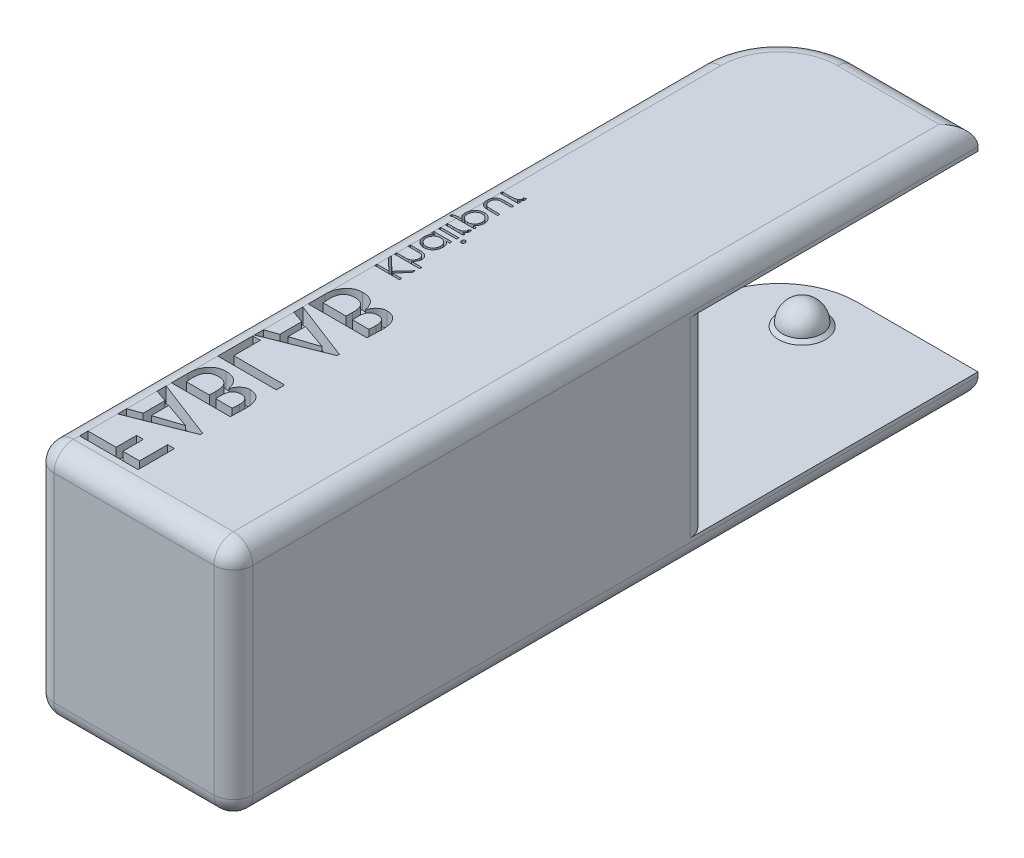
from build123d import *
from build123d.topology import SkipClean

# Parameters (mm, degrees)
SKETCH9_W            = 28.5
SKETCH9_H            = 30.5
SKETCH9_W_2          = 22.5
SKETCH9_H_2          = 24.5
EXTRUDE_THIN5_DEPTH  = 92.5
SKETCH10_W           = 28.5
SKETCH10_H           = 30.5
BOSS_EXTRUDE3_DEPTH  = 3
SKETCH14_W           = 95.5
SKETCH14_H           = 30.5
CUT_EXTRUDE6_DEPTH   = 3
SKETCH16_W           = 34.46402296
SKETCH16_H           = 24.5
CUT_EXTRUDE8_DEPTH   = 3
SKETCH35_R           = 3
BOSS_EXTRUDE12_DEPTH = 0.4
BOSS_EXTRUDE12_TAPER = 50
REVOLVE6_ANGLE       = 180
FILLET5_R            = 10
FILLET6_R            = 2.5
CUT_REVOLVE12_ANGLE  = 180
SKETCH39_W           = 2.320192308
SKETCH39_H           = 0.284935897
CUT_EXTRUDE12_DEPTH  = 2
SKETCH17_R           = 3
BOSS_EXTRUDE13_DEPTH = 0.4
BOSS_EXTRUDE13_TAPER = 50
REVOLVE8_ANGLE       = 180


with BuildPart() as part:
    # Sketch9 → Extrude-Thin5 (new body)
    with BuildSketch(Plane.XY):
        with Locations((11.25, 12.25)):
            Rectangle(SKETCH9_W, SKETCH9_H)
        with Locations((11.25, 12.25)):
            Rectangle(SKETCH9_W_2, SKETCH9_H_2, mode=Mode.SUBTRACT)
    extrude(amount=-EXTRUDE_THIN5_DEPTH)

    # Sketch10 → Boss-Extrude3 (add)
    with BuildSketch(Plane.XY):
        with Locations((11.25, 12.25)):
            Rectangle(SKETCH10_W, SKETCH10_H)
    extrude(amount=BOSS_EXTRUDE3_DEPTH)

    # Sketch14 → Cut-Extrude6 (cut)
    with BuildSketch(Plane(origin=(25.5, 0, 0), x_dir=(0, 0, -1), z_dir=(1, 0, 0))):
        with Locations((44.75, 12.25)):
            Rectangle(SKETCH14_W, SKETCH14_H)
    extrude(amount=-CUT_EXTRUDE6_DEPTH, mode=Mode.SUBTRACT)

    # Sketch16 → Cut-Extrude8 (cut)
    with BuildSketch(Plane(origin=(0, 0, 0), x_dir=(0, 0, -1), z_dir=(1, 0, 0))):
        with Locations((75.26798852, 12.25)):
            Rectangle(SKETCH16_W, SKETCH16_H)
    extrude(amount=-CUT_EXTRUDE8_DEPTH, mode=Mode.SUBTRACT)

    # Sketch35 → Boss-Extrude12 (add)
    with BuildSketch(Plane.XZ.offset(-24.5)):
        with Locations((13.35, -86.3)):
            Circle(SKETCH35_R)
    extrude(amount=BOSS_EXTRUDE12_DEPTH, taper=BOSS_EXTRUDE12_TAPER)

    # Sketch36 → Revolve6 (revolve)
    with SkipClean():  # the faces are left unmerged after this step: merging them gives an invalid solid
        with BuildSketch(Plane.XZ.offset(-24.1)):
            with BuildLine():
                ThreePointArc((13.35, -83.776701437), (10.826701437, -86.3), (13.35, -88.823298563))
                Line((13.35, -88.823298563), (13.35, -83.776701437))
            make_face()
            with BuildLine():
                Line((13.35, -83.776701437), (13.35, -88.823298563))
                ThreePointArc((13.35, -88.823298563), (15.134241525, -88.084241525), (15.873298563, -86.3))
                ThreePointArc((15.873298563, -86.3), (15.134241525, -84.515758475), (13.35, -83.776701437))
            make_face()
        revolve(axis=Axis((13.35, 24.1, -88.823298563), (0, 0, 1)), revolution_arc=REVOLVE6_ANGLE)

    # Fillet5
    fillet5_edges = [part.edges().sort_by_distance(p)[0] for p in [
        (22.5, -1.5, -92.5),
        (22.5, 26, -92.5),
    ]]
    fillet(fillet5_edges, radius=FILLET5_R)

    # Fillet6
    fillet6_edges = [part.edges().sort_by_distance(p)[0] for p in [
        (-3, 12.25, 3),
        (9.75, -3, 3),
        (9.75, 27.5, 3),
        (22.5, 12.25, 3),
        (22.5, -3, -39.75),
        (-3, 27.5, -44.75),
        (-3, -3, -44.75),
        (-3, 12.25, -58.03597704),
        (4.75, -3, -92.5),
        (22.5, 27.5, -39.75),
        (19.571067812, -3, -89.571067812),
        (4.75, 27.5, -92.5),
        (19.571067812, 27.5, -89.571067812),
    ]]
    fillet(fillet6_edges, radius=FILLET6_R)

    # Sketch38 → Cut-Revolve12 (revolve, cut)
    with BuildSketch(Plane.XZ.offset(-24.5)):
        with BuildLine():
            ThreePointArc((16.044289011, -3.396853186), (15.840646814, -1.156789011), (18.080710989, -0.953146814))
            Line((18.080710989, -0.953146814), (16.044289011, -3.396853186))
        make_face()
    revolve(axis=Axis((18.080710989, 24.5, -0.953146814), (-0.6401843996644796, 0, -0.7682212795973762)), revolution_arc=CUT_REVOLVE12_ANGLE, mode=Mode.SUBTRACT)

    # Sketch39 → Cut-Extrude12 (cut)
    # profile 1 of 15: a face of its own
    with BuildSketch(Plane(origin=(0, 27.5, 0), x_dir=(1, 0, 0), z_dir=(0, 1, 0))):
        Polygon((13.376623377, 1.350649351), (15.519480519, 1.350649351), (15.519480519, 3.980519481), (16.396103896, 3.980519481), (16.396103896, 1.350649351), (20, 1.350649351), (20, 0.279220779), (12.5, 0.279220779), (12.5, 4.954545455), (13.376623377, 4.954545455), align=None)
    # profile 2 of 15: a face of its own
    with BuildSketch(Plane(origin=(0, 27.5, 0), x_dir=(1, 0, 0), z_dir=(0, 1, 0))):
        Polygon((20, 10.214285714), (18.441558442, 9.675527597), (18.441558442, 6.864549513), (20, 6.318181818), (20, 5.149350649), (12.402597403, 8.168831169), (12.402597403, 8.461038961), (20, 11.383116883), align=None)
        Polygon((14.350649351, 8.217532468), (17.662337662, 7.132406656), (17.662337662, 9.371144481), align=None, mode=Mode.SUBTRACT)
    # profile 3 of 15: a face of its own
    with BuildSketch(Plane(origin=(0, 27.5, 0), x_dir=(1, 0, 0), z_dir=(0, 1, 0))):
        with BuildLine():
            Line((20, 14.212357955), (20, 12.064935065))
            Line((20, 12.064935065), (12.469561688, 12.064935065))
            add(Edge.make_bspline(
                [(12.469561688, 12.064935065), (12.464445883, 12.174511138), (12.454593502, 12.385540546), (12.441047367, 12.690436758), (12.428222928, 12.971440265), (12.41971457, 13.22919536), (12.411345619, 13.463029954), (12.407267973, 13.673085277), (12.403918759, 13.85926438), (12.403018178, 13.975445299), (12.402597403, 14.029728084)],
                knots=[0, 0, 0, 0, 1.339051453, 2.578840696, 3.725557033, 4.772779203, 5.726954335, 6.58174599, 7.337354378, 8, 8, 8, 8], degree=3))
            add(Edge.make_bspline(
                [(12.402597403, 14.029728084), (12.404102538, 14.119563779), (12.407023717, 14.293917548), (12.428294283, 14.54764441), (12.464206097, 14.785807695), (12.516293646, 15.00846793), (12.580607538, 15.216323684), (12.662120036, 15.407497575), (12.756215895, 15.584065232), (12.866196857, 15.744096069), (12.989015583, 15.888311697), (13.126836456, 16.011677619), (13.27623691, 16.117017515), (13.438673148, 16.202046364), (13.613531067, 16.270143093), (13.80140843, 16.315853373), (14.001136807, 16.346335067), (14.13847513, 16.349184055), (14.209111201, 16.350649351)],
                knots=[0, 0, 0, 0, 1.293171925, 2.509797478, 3.662491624, 4.7572812, 5.798971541, 6.790532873, 7.744676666, 8.674473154, 9.580681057, 10.46496469, 11.330102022, 12.205626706, 13.09804565, 14.024422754, 14.983917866, 16, 16, 16, 16], degree=3))
            add(Edge.make_bspline(
                [(14.209111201, 16.350649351), (14.251292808, 16.349525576), (14.335040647, 16.34729442), (14.459313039, 16.327888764), (14.581256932, 16.298661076), (14.698938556, 16.252417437), (14.815488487, 16.199180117), (14.926303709, 16.128442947), (15.037176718, 16.050044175), (15.175467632, 15.927198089), (15.332394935, 15.762587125), (15.483867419, 15.547368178), (15.602392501, 15.323323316), (15.644636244, 15.163613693), (15.665584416, 15.084415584)],
                knots=[0, 0, 0, 0, 0.73324583, 1.455794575, 2.183444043, 2.909486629, 3.651546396, 4.40825657, 5.191959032, 6.011265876, 7.621841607, 9.134876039, 10.579218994, 12, 12, 12, 12], degree=3))
            add(Edge.make_bspline(
                [(15.665584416, 15.084415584), (15.68451075, 15.158218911), (15.721493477, 15.302433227), (15.789852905, 15.508922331), (15.867003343, 15.699939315), (15.954633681, 15.874623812), (16.049458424, 16.034847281), (16.155394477, 16.178278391), (16.268200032, 16.307921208), (16.392213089, 16.421347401), (16.527720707, 16.519150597), (16.673028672, 16.604486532), (16.828732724, 16.678759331), (16.99773101, 16.735659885), (17.177394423, 16.781139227), (17.368586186, 16.814737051), (17.571101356, 16.834668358), (17.709978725, 16.836648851), (17.781047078, 16.837662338)],
                knots=[0, 0, 0, 0, 1.208997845, 2.362424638, 3.449441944, 4.475685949, 5.461623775, 6.400508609, 7.301874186, 8.185258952, 9.061385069, 9.949308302, 10.856981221, 11.794034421, 12.774367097, 13.796306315, 14.872293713, 16, 16, 16, 16], degree=3))
            add(Edge.make_bspline(
                [(17.781047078, 16.837662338), (17.863371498, 16.835987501), (18.024749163, 16.832704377), (18.259712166, 16.796062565), (18.482352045, 16.740254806), (18.692488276, 16.661408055), (18.888147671, 16.556241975), (19.072353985, 16.430848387), (19.243619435, 16.282403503), (19.399649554, 16.111473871), (19.540601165, 15.923257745), (19.664735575, 15.720281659), (19.768015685, 15.502605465), (19.854183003, 15.271694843), (19.918549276, 15.026215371), (19.965708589, 14.767284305), (19.99543927, 14.494605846), (19.998457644, 14.307809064), (20, 14.212357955)],
                knots=[0, 0, 0, 0, 1.021251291, 2.00192299, 2.944416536, 3.867325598, 4.780187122, 5.695565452, 6.628732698, 7.587065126, 8.56327736, 9.544050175, 10.535642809, 11.549956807, 12.599500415, 13.681645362, 14.815346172, 16, 16, 16, 16], degree=3))
        make_face()
        with BuildLine():
            Line((13.279220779, 13.136363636), (15.390117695, 13.136363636))
            add(Edge.make_bspline(
                [(15.390117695, 13.136363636), (15.394951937, 13.190624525), (15.405152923, 13.305123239), (15.415563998, 13.485782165), (15.42165637, 13.684717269), (15.421933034, 13.823250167), (15.422077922, 13.895799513)],
                knots=[0, 0, 0, 0, 0.859626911, 1.813943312, 2.855167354, 4, 4, 4, 4], degree=3))
            add(Edge.make_bspline(
                [(15.422077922, 13.895799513), (15.421261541, 13.951633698), (15.419678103, 14.05992868), (15.405786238, 14.217021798), (15.383452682, 14.36359113), (15.351427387, 14.498824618), (15.312151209, 14.624068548), (15.262467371, 14.738114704), (15.201758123, 14.840691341), (15.13584574, 14.935045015), (15.05688608, 15.015988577), (14.969784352, 15.086107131), (14.874171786, 15.146745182), (14.768926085, 15.19473139), (14.655232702, 15.233064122), (14.532411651, 15.260830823), (14.400191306, 15.275039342), (14.309079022, 15.277803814), (14.262378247, 15.279220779)],
                knots=[0, 0, 0, 0, 1.296828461, 2.515305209, 3.660389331, 4.738053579, 5.740607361, 6.706255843, 7.619875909, 8.506259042, 9.373075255, 10.236278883, 11.09948251, 11.995837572, 12.91634841, 13.882715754, 14.914758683, 16, 16, 16, 16], degree=3))
            add(Edge.make_bspline(
                [(14.262378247, 15.279220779), (14.221228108, 15.278553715), (14.141161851, 15.277255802), (14.025116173, 15.261169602), (13.916676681, 15.237801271), (13.816383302, 15.20257301), (13.725322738, 15.156091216), (13.639551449, 15.103130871), (13.56378457, 15.037271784), (13.496571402, 14.961224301), (13.434584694, 14.87766376), (13.383300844, 14.781893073), (13.33903651, 14.677062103), (13.304446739, 14.562074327), (13.277663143, 14.437795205), (13.255110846, 14.303899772), (13.246172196, 14.159207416), (13.243876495, 14.059661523), (13.242694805, 14.008421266)],
                knots=[0, 0, 0, 0, 1.059624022, 2.06172158, 3.013167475, 3.914528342, 4.791479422, 5.643722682, 6.505834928, 7.366756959, 8.255804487, 9.18019209, 10.158646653, 11.184175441, 12.26890402, 13.433779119, 14.679063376, 16, 16, 16, 16], degree=3))
            add(Edge.make_bspline(
                [(13.242694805, 14.008421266), (13.243547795, 13.929281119), (13.245204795, 13.77554513), (13.250293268, 13.551191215), (13.263077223, 13.339655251), (13.273944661, 13.202804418), (13.279220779, 13.136363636)],
                knots=[0, 0, 0, 0, 1.087806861, 2.11315079, 3.083938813, 4, 4, 4, 4], degree=3))
        make_face(mode=Mode.SUBTRACT)
        with BuildLine():
            Line((16.227171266, 13.136363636), (19.169034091, 13.136363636))
            add(Edge.make_bspline(
                [(19.169034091, 13.136363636), (19.176844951, 13.218528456), (19.191445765, 13.372118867), (19.20895339, 13.587671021), (19.218444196, 13.77243648), (19.220051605, 13.885645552), (19.220779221, 13.936891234)],
                knots=[0, 0, 0, 0, 1.234185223, 2.307058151, 3.233666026, 4, 4, 4, 4], degree=3))
            add(Edge.make_bspline(
                [(19.220779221, 13.936891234), (19.219538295, 14.013522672), (19.217135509, 14.161902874), (19.200804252, 14.376472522), (19.172237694, 14.575393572), (19.131627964, 14.757615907), (19.079665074, 14.924307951), (19.016532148, 15.075289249), (18.940243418, 15.210126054), (18.852174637, 15.328994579), (18.752976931, 15.434764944), (18.636757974, 15.522171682), (18.510256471, 15.599967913), (18.367692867, 15.660052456), (18.212557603, 15.709522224), (18.042779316, 15.741066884), (17.860307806, 15.764067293), (17.733950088, 15.765493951), (17.668425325, 15.766233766)],
                knots=[0, 0, 0, 0, 1.32816977, 2.571713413, 3.726913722, 4.808420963, 5.803983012, 6.749560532, 7.639497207, 8.481858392, 9.308983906, 10.142626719, 10.994615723, 11.876699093, 12.81665923, 13.811638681, 14.865191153, 16, 16, 16, 16], degree=3))
            add(Edge.make_bspline(
                [(17.668425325, 15.766233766), (17.608002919, 15.765224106), (17.490362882, 15.763258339), (17.320152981, 15.743537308), (17.162267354, 15.71001276), (17.016949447, 15.664337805), (16.882632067, 15.607109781), (16.762170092, 15.533101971), (16.653200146, 15.44745437), (16.55560089, 15.348973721), (16.470873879, 15.234078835), (16.397961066, 15.102586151), (16.337287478, 14.953142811), (16.287534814, 14.786422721), (16.248096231, 14.602239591), (16.221772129, 14.400677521), (16.204727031, 14.18221151), (16.202470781, 14.030777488), (16.201298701, 13.95211039)],
                knots=[0, 0, 0, 0, 1.076720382, 2.096332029, 3.048766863, 3.949665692, 4.808175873, 5.64409988, 6.461825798, 7.27393223, 8.107701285, 8.998329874, 9.947151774, 10.977017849, 12.096191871, 13.300910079, 14.597874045, 16, 16, 16, 16], degree=3))
            Line((16.201298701, 13.95211039), (16.227171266, 13.136363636))
        make_face(mode=Mode.SUBTRACT)
    # profile 4 of 15: a face of its own
    with BuildSketch(Plane(origin=(0, 27.5, 0), x_dir=(1, 0, 0), z_dir=(0, 1, 0))):
        Polygon((20, 18.006493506), (12.5, 18.006493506), (12.5, 19.077922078), (19.025974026, 19.077922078), (19.025974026, 22.487012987), (20, 22.487012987), align=None)
    # profile 5 of 15: a face of its own
    with BuildSketch(Plane(origin=(0, 27.5, 0), x_dir=(1, 0, 0), z_dir=(0, 1, 0))):
        Polygon((20, 27.746753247), (18.441558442, 27.20799513), (18.441558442, 24.397017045), (20, 23.850649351), (20, 22.681818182), (12.402597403, 25.701298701), (12.402597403, 25.993506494), (20, 28.915584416), align=None)
        Polygon((14.350649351, 25.75), (17.662337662, 24.664874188), (17.662337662, 26.903612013), align=None, mode=Mode.SUBTRACT)
    # profile 6 of 15: a face of its own
    with BuildSketch(Plane(origin=(0, 27.5, 0), x_dir=(1, 0, 0), z_dir=(0, 1, 0))):
        with BuildLine():
            Line((20, 31.744825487), (20, 29.597402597))
            Line((20, 29.597402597), (12.469561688, 29.597402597))
            add(Edge.make_bspline(
                [(12.469561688, 29.597402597), (12.464445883, 29.70697867), (12.454593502, 29.918008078), (12.441047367, 30.22290429), (12.428222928, 30.503907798), (12.41971457, 30.761662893), (12.411345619, 30.995497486), (12.407267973, 31.205552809), (12.403918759, 31.391731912), (12.403018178, 31.507912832), (12.402597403, 31.562195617)],
                knots=[0, 0, 0, 0, 1.339051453, 2.578840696, 3.725557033, 4.772779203, 5.726954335, 6.58174599, 7.337354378, 8, 8, 8, 8], degree=3))
            add(Edge.make_bspline(
                [(12.402597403, 31.562195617), (12.404102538, 31.652031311), (12.407023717, 31.82638508), (12.428294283, 32.080111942), (12.464206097, 32.318275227), (12.516293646, 32.540935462), (12.580607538, 32.748791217), (12.662120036, 32.939965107), (12.756215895, 33.116532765), (12.866196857, 33.276563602), (12.989015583, 33.420779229), (13.126836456, 33.544145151), (13.27623691, 33.649485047), (13.438673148, 33.734513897), (13.613531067, 33.802610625), (13.80140843, 33.848320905), (14.001136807, 33.8788026), (14.13847513, 33.881651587), (14.209111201, 33.883116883)],
                knots=[0, 0, 0, 0, 1.293171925, 2.509797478, 3.662491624, 4.7572812, 5.798971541, 6.790532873, 7.744676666, 8.674473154, 9.580681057, 10.46496469, 11.330102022, 12.205626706, 13.09804565, 14.024422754, 14.983917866, 16, 16, 16, 16], degree=3))
            add(Edge.make_bspline(
                [(14.209111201, 33.883116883), (14.251292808, 33.881993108), (14.335040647, 33.879761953), (14.459313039, 33.860356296), (14.581256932, 33.831128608), (14.698938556, 33.784884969), (14.815488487, 33.73164765), (14.926303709, 33.660910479), (15.037176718, 33.582511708), (15.175467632, 33.459665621), (15.332394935, 33.295054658), (15.483867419, 33.07983571), (15.602392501, 32.855790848), (15.644636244, 32.696081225), (15.665584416, 32.616883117)],
                knots=[0, 0, 0, 0, 0.73324583, 1.455794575, 2.183444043, 2.909486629, 3.651546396, 4.40825657, 5.191959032, 6.011265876, 7.621841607, 9.134876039, 10.579218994, 12, 12, 12, 12], degree=3))
            add(Edge.make_bspline(
                [(15.665584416, 32.616883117), (15.68451075, 32.690686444), (15.721493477, 32.83490076), (15.789852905, 33.041389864), (15.867003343, 33.232406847), (15.954633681, 33.407091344), (16.049458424, 33.567314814), (16.155394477, 33.710745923), (16.268200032, 33.840388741), (16.392213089, 33.953814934), (16.527720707, 34.05161813), (16.673028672, 34.136954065), (16.828732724, 34.211226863), (16.99773101, 34.268127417), (17.177394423, 34.31360676), (17.368586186, 34.347204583), (17.571101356, 34.36713589), (17.709978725, 34.369116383), (17.781047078, 34.37012987)],
                knots=[0, 0, 0, 0, 1.208997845, 2.362424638, 3.449441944, 4.475685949, 5.461623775, 6.400508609, 7.301874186, 8.185258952, 9.061385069, 9.949308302, 10.856981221, 11.794034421, 12.774367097, 13.796306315, 14.872293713, 16, 16, 16, 16], degree=3))
            add(Edge.make_bspline(
                [(17.781047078, 34.37012987), (17.863371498, 34.368455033), (18.024749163, 34.365171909), (18.259712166, 34.328530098), (18.482352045, 34.272722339), (18.692488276, 34.193875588), (18.888147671, 34.088709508), (19.072353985, 33.963315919), (19.243619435, 33.814871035), (19.399649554, 33.643941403), (19.540601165, 33.455725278), (19.664735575, 33.252749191), (19.768015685, 33.035072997), (19.854183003, 32.804162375), (19.918549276, 32.558682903), (19.965708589, 32.299751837), (19.99543927, 32.027073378), (19.998457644, 31.840276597), (20, 31.744825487)],
                knots=[0, 0, 0, 0, 1.021251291, 2.00192299, 2.944416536, 3.867325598, 4.780187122, 5.695565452, 6.628732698, 7.587065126, 8.56327736, 9.544050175, 10.535642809, 11.549956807, 12.599500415, 13.681645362, 14.815346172, 16, 16, 16, 16], degree=3))
        make_face()
        with BuildLine():
            Line((13.279220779, 30.668831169), (15.390117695, 30.668831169))
            add(Edge.make_bspline(
                [(15.390117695, 30.668831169), (15.394951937, 30.723092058), (15.405152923, 30.837590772), (15.415563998, 31.018249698), (15.42165637, 31.217184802), (15.421933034, 31.355717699), (15.422077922, 31.428267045)],
                knots=[0, 0, 0, 0, 0.859626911, 1.813943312, 2.855167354, 4, 4, 4, 4], degree=3))
            add(Edge.make_bspline(
                [(15.422077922, 31.428267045), (15.421261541, 31.48410123), (15.419678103, 31.592396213), (15.405786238, 31.74948933), (15.383452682, 31.896058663), (15.351427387, 32.03129215), (15.312151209, 32.15653608), (15.262467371, 32.270582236), (15.201758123, 32.373158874), (15.13584574, 32.467512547), (15.05688608, 32.54845611), (14.969784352, 32.618574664), (14.874171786, 32.679212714), (14.768926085, 32.727198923), (14.655232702, 32.765531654), (14.532411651, 32.793298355), (14.400191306, 32.807506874), (14.309079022, 32.810271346), (14.262378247, 32.811688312)],
                knots=[0, 0, 0, 0, 1.296828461, 2.515305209, 3.660389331, 4.738053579, 5.740607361, 6.706255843, 7.619875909, 8.506259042, 9.373075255, 10.236278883, 11.09948251, 11.995837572, 12.91634841, 13.882715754, 14.914758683, 16, 16, 16, 16], degree=3))
            add(Edge.make_bspline(
                [(14.262378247, 32.811688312), (14.221228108, 32.811021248), (14.141161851, 32.809723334), (14.025116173, 32.793637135), (13.916676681, 32.770268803), (13.816383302, 32.735040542), (13.725322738, 32.688558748), (13.639551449, 32.635598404), (13.56378457, 32.569739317), (13.496571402, 32.493691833), (13.434584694, 32.410131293), (13.383300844, 32.314360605), (13.33903651, 32.209529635), (13.304446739, 32.09454186), (13.277663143, 31.970262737), (13.255110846, 31.836367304), (13.246172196, 31.691674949), (13.243876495, 31.592129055), (13.242694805, 31.540888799)],
                knots=[0, 0, 0, 0, 1.059624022, 2.06172158, 3.013167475, 3.914528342, 4.791479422, 5.643722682, 6.505834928, 7.366756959, 8.255804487, 9.18019209, 10.158646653, 11.184175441, 12.26890402, 13.433779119, 14.679063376, 16, 16, 16, 16], degree=3))
            add(Edge.make_bspline(
                [(13.242694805, 31.540888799), (13.243547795, 31.461748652), (13.245204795, 31.308012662), (13.250293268, 31.083658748), (13.263077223, 30.872122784), (13.273944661, 30.735271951), (13.279220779, 30.668831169)],
                knots=[0, 0, 0, 0, 1.087806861, 2.11315079, 3.083938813, 4, 4, 4, 4], degree=3))
        make_face(mode=Mode.SUBTRACT)
        with BuildLine():
            Line((16.227171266, 30.668831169), (19.169034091, 30.668831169))
            add(Edge.make_bspline(
                [(19.169034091, 30.668831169), (19.176844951, 30.750995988), (19.191445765, 30.904586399), (19.20895339, 31.120138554), (19.218444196, 31.304904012), (19.220051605, 31.418113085), (19.220779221, 31.469358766)],
                knots=[0, 0, 0, 0, 1.234185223, 2.307058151, 3.233666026, 4, 4, 4, 4], degree=3))
            add(Edge.make_bspline(
                [(19.220779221, 31.469358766), (19.219538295, 31.545990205), (19.217135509, 31.694370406), (19.200804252, 31.908940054), (19.172237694, 32.107861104), (19.131627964, 32.290083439), (19.079665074, 32.456775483), (19.016532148, 32.607756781), (18.940243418, 32.742593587), (18.852174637, 32.861462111), (18.752976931, 32.967232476), (18.636757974, 33.054639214), (18.510256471, 33.132435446), (18.367692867, 33.192519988), (18.212557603, 33.241989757), (18.042779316, 33.273534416), (17.860307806, 33.296534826), (17.733950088, 33.297961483), (17.668425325, 33.298701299)],
                knots=[0, 0, 0, 0, 1.32816977, 2.571713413, 3.726913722, 4.808420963, 5.803983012, 6.749560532, 7.639497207, 8.481858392, 9.308983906, 10.142626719, 10.994615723, 11.876699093, 12.81665923, 13.811638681, 14.865191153, 16, 16, 16, 16], degree=3))
            add(Edge.make_bspline(
                [(17.668425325, 33.298701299), (17.608002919, 33.297691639), (17.490362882, 33.295725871), (17.320152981, 33.276004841), (17.162267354, 33.242480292), (17.016949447, 33.196805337), (16.882632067, 33.139577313), (16.762170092, 33.065569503), (16.653200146, 32.979921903), (16.55560089, 32.881441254), (16.470873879, 32.766546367), (16.397961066, 32.635053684), (16.337287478, 32.485610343), (16.287534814, 32.318890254), (16.248096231, 32.134707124), (16.221772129, 31.933145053), (16.204727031, 31.714679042), (16.202470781, 31.56324502), (16.201298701, 31.484577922)],
                knots=[0, 0, 0, 0, 1.076720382, 2.096332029, 3.048766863, 3.949665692, 4.808175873, 5.64409988, 6.461825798, 7.27393223, 8.107701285, 8.998329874, 9.947151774, 10.977017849, 12.096191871, 13.300910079, 14.597874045, 16, 16, 16, 16], degree=3))
            Line((16.201298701, 31.484577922), (16.227171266, 30.668831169))
        make_face(mode=Mode.SUBTRACT)
    # profile 7 of 15: a face of its own
    with BuildSketch(Plane(origin=(0, 27.5, 0), x_dir=(1, 0, 0), z_dir=(0, 1, 0))):
        Polygon((16.825, 38.130288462), (16.825, 38.415224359), (18.034069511, 38.415224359), (16.825, 39.738777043), (16.825, 40.145192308), (18.249679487, 38.585041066), (20, 40.267307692), (20, 39.887605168), (18.467833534, 38.415224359), (20, 38.415224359), (20, 38.130288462), align=None)
    # profile 8 of 15: a face of its own
    with BuildSketch(Plane(origin=(0, 27.5, 0), x_dir=(1, 0, 0), z_dir=(0, 1, 0))):
        with BuildLine():
            Line((16.743589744, 40.65400641), (16.743589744, 40.938942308))
            Line((16.743589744, 40.938942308), (18.118023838, 40.938942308))
            add(Edge.make_bspline(
                [(18.118023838, 40.938942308), (18.079797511, 40.969531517), (18.005368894, 41.029090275), (17.908190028, 41.129287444), (17.824146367, 41.232444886), (17.756355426, 41.341258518), (17.703324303, 41.454778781), (17.666746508, 41.573168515), (17.643423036, 41.695950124), (17.640555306, 41.779440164), (17.639102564, 41.821734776)],
                knots=[0, 0, 0, 0, 1.125633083, 2.191665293, 3.205031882, 4.182434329, 5.134135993, 6.080017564, 7.027370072, 8, 8, 8, 8], degree=3))
            add(Edge.make_bspline(
                [(17.639102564, 41.821734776), (17.640593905, 41.864692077), (17.643514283, 41.948812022), (17.669320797, 42.070829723), (17.709921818, 42.185487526), (17.767569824, 42.291096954), (17.838766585, 42.386519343), (17.921823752, 42.470039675), (18.016753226, 42.539513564), (18.104967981, 42.586063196), (18.183450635, 42.616544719), (18.250798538, 42.635817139), (18.32583767, 42.652164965), (18.408537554, 42.666406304), (18.49929268, 42.675898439), (18.597694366, 42.683522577), (18.70373674, 42.68894409), (18.777142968, 42.689154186), (18.815099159, 42.689262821)],
                knots=[0, 0, 0, 0, 1.235771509, 2.41991536, 3.57472251, 4.727526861, 5.870395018, 6.992794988, 8.106410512, 9.245194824, 9.854018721, 10.52826073, 11.259975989, 12.064917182, 12.943387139, 13.886414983, 14.90712766, 16, 16, 16, 16], degree=3))
            Line((18.815099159, 42.689262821), (20, 42.689262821))
            Line((20, 42.689262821), (20, 42.404326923))
            Line((20, 42.404326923), (18.90859375, 42.404326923))
            add(Edge.make_bspline(
                [(18.90859375, 42.404326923), (18.877004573, 42.404154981), (18.816579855, 42.403826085), (18.730069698, 42.402725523), (18.65181524, 42.400324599), (18.581654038, 42.396301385), (18.519681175, 42.39225309), (18.465795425, 42.386513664), (18.42033483, 42.379885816), (18.392971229, 42.373926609), (18.380699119, 42.371254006)],
                knots=[0, 0, 0, 0, 1.430934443, 2.737134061, 3.918973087, 4.976914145, 5.92044225, 6.731742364, 7.431207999, 8, 8, 8, 8], degree=3))
            add(Edge.make_bspline(
                [(18.380699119, 42.371254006), (18.344664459, 42.360938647), (18.275571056, 42.34115982), (18.181882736, 42.29427009), (18.101287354, 42.237064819), (18.036035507, 42.166170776), (17.98483484, 42.084061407), (17.94940251, 41.989834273), (17.927404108, 41.884442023), (17.92519164, 41.810190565), (17.924038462, 41.771489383)],
                knots=[0, 0, 0, 0, 1.090133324, 2.090238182, 3.036763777, 3.954757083, 4.878717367, 5.838952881, 6.873623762, 8, 8, 8, 8], degree=3))
            add(Edge.make_bspline(
                [(17.924038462, 41.771489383), (17.924463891, 41.748565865), (17.925305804, 41.703200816), (17.933972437, 41.635967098), (17.947660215, 41.570544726), (17.967878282, 41.507109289), (17.992459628, 41.44553139), (18.022625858, 41.38556072), (18.059100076, 41.328018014), (18.100151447, 41.272160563), (18.145565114, 41.220162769), (18.193506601, 41.171788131), (18.244555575, 41.128663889), (18.297895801, 41.089594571), (18.354258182, 41.055868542), (18.413099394, 41.026428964), (18.474496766, 41.001450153), (18.517109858, 40.989037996), (18.53843149, 40.982827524)],
                knots=[0, 0, 0, 0, 1.024369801, 2.02720137, 3.025498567, 4.008789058, 4.999724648, 5.987391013, 7.005161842, 8.042127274, 9.083588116, 10.088924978, 11.084112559, 12.068088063, 13.041783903, 14.016724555, 15.007660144, 16, 16, 16, 16], degree=3))
            add(Edge.make_bspline(
                [(18.53843149, 40.982827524), (18.553871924, 40.979253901), (18.587518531, 40.971466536), (18.643012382, 40.963016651), (18.707497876, 40.955453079), (18.780877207, 40.949059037), (18.863419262, 40.94513738), (18.954560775, 40.94091169), (19.054872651, 40.939338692), (19.124627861, 40.939078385), (19.161092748, 40.938942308)],
                knots=[0, 0, 0, 0, 0.607992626, 1.324890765, 2.152360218, 3.099583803, 4.150613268, 5.323148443, 6.60066238, 8, 8, 8, 8], degree=3))
            Line((19.161092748, 40.938942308), (20, 40.938942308))
            Line((20, 40.938942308), (20, 40.65400641))
            Line((20, 40.65400641), (16.743589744, 40.65400641))
        make_face()
    # profile 9 of 15: a face of its own
    with BuildSketch(Plane(origin=(0, 27.5, 0), x_dir=(1, 0, 0), z_dir=(0, 1, 0))):
        with BuildLine():
            Line((17.679807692, 45.701442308), (20, 45.701442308))
            Line((20, 45.701442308), (20, 45.41650641))
            Line((20, 45.41650641), (19.598672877, 45.41650641))
            add(Edge.make_bspline(
                [(19.598672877, 45.41650641), (19.63493466, 45.384326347), (19.705805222, 45.32143316), (19.799241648, 45.217379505), (19.87489951, 45.105711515), (19.936891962, 44.989231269), (19.983270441, 44.866797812), (20.016294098, 44.739051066), (20.037511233, 44.605868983), (20.039630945, 44.514926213), (20.040705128, 44.468840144)],
                knots=[0, 0, 0, 0, 1.074325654, 2.099677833, 3.090439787, 4.057542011, 5.018572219, 5.985274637, 6.979019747, 8, 8, 8, 8], degree=3))
            add(Edge.make_bspline(
                [(20.040705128, 44.468840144), (20.039592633, 44.427866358), (20.037398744, 44.347064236), (20.020378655, 44.228202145), (19.993045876, 44.113818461), (19.955035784, 44.003805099), (19.904616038, 43.898873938), (19.844253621, 43.798126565), (19.772370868, 43.702084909), (19.690194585, 43.61221287), (19.600936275, 43.529452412), (19.505735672, 43.456825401), (19.405004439, 43.396270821), (19.300017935, 43.345634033), (19.189967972, 43.306630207), (19.075235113, 43.279439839), (18.955955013, 43.262439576), (18.874729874, 43.260246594), (18.83354367, 43.259134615)],
                knots=[0, 0, 0, 0, 1.033919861, 2.038935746, 3.024066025, 3.998881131, 4.97069526, 5.957263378, 6.95902576, 7.993208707, 9.027059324, 10.027763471, 11.009749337, 11.988697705, 12.965288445, 13.950418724, 14.960734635, 16, 16, 16, 16], degree=3))
            add(Edge.make_bspline(
                [(18.83354367, 43.259134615), (18.793208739, 43.260271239), (18.713468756, 43.262518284), (18.596194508, 43.27925799), (18.483238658, 43.307407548), (18.374964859, 43.346911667), (18.271242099, 43.397568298), (18.17199702, 43.459188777), (18.076956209, 43.531777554), (17.988354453, 43.615463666), (17.906511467, 43.706118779), (17.835383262, 43.803100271), (17.773954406, 43.903995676), (17.725283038, 44.010369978), (17.685904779, 44.120648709), (17.658660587, 44.235813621), (17.642606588, 44.355385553), (17.640281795, 44.436566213), (17.639102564, 44.477744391)],
                knots=[0, 0, 0, 0, 1.020392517, 2.01726096, 2.990465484, 3.961182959, 4.928053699, 5.906110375, 6.912531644, 7.948652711, 8.985773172, 9.998621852, 10.987621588, 11.969261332, 12.953316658, 13.946091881, 14.958173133, 16, 16, 16, 16], degree=3))
            add(Edge.make_bspline(
                [(17.639102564, 44.477744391), (17.640408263, 44.525096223), (17.642968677, 44.617950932), (17.664232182, 44.753788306), (17.700264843, 44.882233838), (17.748940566, 45.004651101), (17.814977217, 45.119355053), (17.895948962, 45.227773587), (17.995203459, 45.327600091), (18.070490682, 45.386358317), (18.109119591, 45.41650641)],
                knots=[0, 0, 0, 0, 1.039007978, 2.037445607, 3.008437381, 3.96246474, 4.921201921, 5.904967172, 6.925065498, 8, 8, 8, 8], degree=3))
            Line((18.109119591, 45.41650641), (17.679807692, 45.41650641))
            Line((17.679807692, 45.41650641), (17.679807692, 45.701442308))
        make_face()
        with BuildLine():
            add(Edge.make_bspline(
                [(17.924038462, 44.481560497), (17.925521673, 44.43991053), (17.928449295, 44.357700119), (17.95126691, 44.23699724), (17.989331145, 44.121554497), (18.041083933, 44.011551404), (18.107394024, 43.910055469), (18.185519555, 43.817754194), (18.276779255, 43.737493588), (18.377907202, 43.66846966), (18.486920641, 43.613058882), (18.600840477, 43.573848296), (18.717695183, 43.548036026), (18.796944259, 43.545395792), (18.836723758, 43.544070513)],
                knots=[0, 0, 0, 0, 1.031130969, 2.035288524, 3.029955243, 4.035265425, 5.037320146, 6.024362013, 7.021230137, 8.037832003, 9.049975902, 10.039737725, 11.016035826, 12, 12, 12, 12], degree=3))
            add(Edge.make_bspline(
                [(18.836723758, 43.544070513), (18.876263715, 43.545769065), (18.955188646, 43.54915951), (19.072033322, 43.573283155), (19.185697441, 43.61428558), (19.295586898, 43.669621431), (19.397702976, 43.739457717), (19.490601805, 43.81964199), (19.569949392, 43.91238735), (19.636419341, 44.014790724), (19.690079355, 44.124209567), (19.727424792, 44.23926339), (19.751534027, 44.357805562), (19.754350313, 44.438407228), (19.755769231, 44.479016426)],
                knots=[0, 0, 0, 0, 0.979154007, 1.954470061, 2.941101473, 3.965068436, 4.993389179, 5.998216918, 6.996159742, 8.005560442, 9.015493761, 10.005250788, 10.994993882, 12, 12, 12, 12], degree=3))
            add(Edge.make_bspline(
                [(19.755769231, 44.479016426), (19.75424601, 44.520237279), (19.751216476, 44.602221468), (19.728527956, 44.72341723), (19.689621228, 44.840629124), (19.63733461, 44.95305758), (19.572210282, 45.057691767), (19.495967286, 45.151284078), (19.407906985, 45.231359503), (19.31000334, 45.298028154), (19.203356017, 45.350899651), (19.089927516, 45.389558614), (18.969487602, 45.412161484), (18.887064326, 45.415038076), (18.844991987, 45.41650641)],
                knots=[0, 0, 0, 0, 1.01787422, 2.024450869, 3.03297362, 4.061474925, 5.080076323, 6.069755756, 7.033548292, 8.009625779, 8.9862229, 9.964937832, 10.961217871, 12, 12, 12, 12], degree=3))
            add(Edge.make_bspline(
                [(18.844991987, 45.41650641), (18.812935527, 45.415635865), (18.749838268, 45.413922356), (18.65719402, 45.400831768), (18.568535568, 45.38000837), (18.4837697, 45.350665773), (18.403365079, 45.312120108), (18.326744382, 45.265631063), (18.254306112, 45.21038112), (18.187047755, 45.147259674), (18.125700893, 45.078166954), (18.070941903, 45.005056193), (18.025957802, 44.927061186), (17.988727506, 44.845493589), (17.959100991, 44.760211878), (17.93933644, 44.670522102), (17.925765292, 44.577377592), (17.924620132, 44.513835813), (17.924038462, 44.481560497)],
                knots=[0, 0, 0, 0, 1.050140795, 2.067009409, 3.05949893, 4.030605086, 5.00011959, 5.97591094, 6.962425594, 7.979863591, 8.993523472, 9.986985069, 10.967611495, 11.937549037, 12.921786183, 13.919465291, 14.943216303, 16, 16, 16, 16], degree=3))
        make_face(mode=Mode.SUBTRACT)
    # profile 10 of 15: a face of its own
    with BuildSketch(Plane(origin=(0, 27.5, 0), x_dir=(1, 0, 0), z_dir=(0, 1, 0))):
        with BuildLine():
            add(Edge.make_bspline(
                [(16.702884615, 46.453215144), (16.703704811, 46.470896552), (16.705310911, 46.505520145), (16.719064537, 46.555588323), (16.742377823, 46.601178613), (16.773655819, 46.641616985), (16.810439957, 46.676316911), (16.853312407, 46.700610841), (16.899629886, 46.716224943), (16.93193786, 46.718110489), (16.94838742, 46.719070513)],
                knots=[0, 0, 0, 0, 1.055194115, 2.066272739, 3.074728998, 4.095836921, 5.109056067, 6.073838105, 7.019297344, 8, 8, 8, 8], degree=3))
            add(Edge.make_bspline(
                [(16.94838742, 46.719070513), (16.96440997, 46.718088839), (16.996084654, 46.716148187), (17.041599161, 46.700622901), (17.083875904, 46.676109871), (17.120588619, 46.641639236), (17.151849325, 46.601172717), (17.175167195, 46.55558989), (17.188919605, 46.505519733), (17.190525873, 46.470896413), (17.191346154, 46.453215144)],
                knots=[0, 0, 0, 0, 0.96129708, 1.900370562, 2.859976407, 3.87933698, 4.906634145, 5.921202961, 6.938410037, 8, 8, 8, 8], degree=3))
            add(Edge.make_bspline(
                [(17.191346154, 46.453215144), (17.190557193, 46.435736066), (17.189021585, 46.401715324), (17.174897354, 46.352396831), (17.151841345, 46.307195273), (17.120793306, 46.266678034), (17.083650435, 46.232904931), (17.041624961, 46.208322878), (16.996078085, 46.192833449), (16.964407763, 46.190887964), (16.94838742, 46.189903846)],
                knots=[0, 0, 0, 0, 1.054934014, 2.053291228, 3.073705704, 4.106921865, 5.123545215, 6.088680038, 7.033164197, 8, 8, 8, 8], degree=3))
            add(Edge.make_bspline(
                [(16.94838742, 46.189903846), (16.931940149, 46.190866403), (16.899636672, 46.192756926), (16.853286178, 46.208334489), (16.810667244, 46.232700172), (16.773451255, 46.266700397), (16.742385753, 46.307189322), (16.719334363, 46.352398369), (16.705208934, 46.401714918), (16.703673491, 46.435735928), (16.702884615, 46.453215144)],
                knots=[0, 0, 0, 0, 0.98631895, 1.937192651, 2.907499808, 3.917963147, 4.944918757, 5.95915025, 6.951458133, 8, 8, 8, 8], degree=3))
        make_face()
    # profile 11 of 15: a face of its own
    with BuildSketch(Plane(origin=(0, 27.5, 0), x_dir=(1, 0, 0), z_dir=(0, 1, 0))):
        with Locations((18.839903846, 46.45448718)):
            Rectangle(SKETCH39_W, SKETCH39_H)
    # profile 12 of 15: a face of its own
    with BuildSketch(Plane(origin=(0, 27.5, 0), x_dir=(1, 0, 0), z_dir=(0, 1, 0))):
        with BuildLine():
            Line((17.679807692, 47.166826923), (17.679807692, 47.451762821))
            Line((17.679807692, 47.451762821), (18.021349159, 47.451762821))
            add(Edge.make_bspline(
                [(18.021349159, 47.451762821), (17.989534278, 47.472784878), (17.928688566, 47.512989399), (17.848324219, 47.580126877), (17.781025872, 47.648162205), (17.728076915, 47.718881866), (17.688060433, 47.791592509), (17.659942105, 47.865681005), (17.642505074, 47.941328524), (17.640238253, 47.992287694), (17.639102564, 48.01781851)],
                knots=[0, 0, 0, 0, 1.280091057, 2.448164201, 3.510831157, 4.48793739, 5.405868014, 6.289422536, 7.142991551, 8, 8, 8, 8], degree=3))
            add(Edge.make_bspline(
                [(17.639102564, 48.01781851), (17.640182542, 48.037618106), (17.642404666, 48.078357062), (17.658017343, 48.140026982), (17.682943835, 48.203566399), (17.706384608, 48.244516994), (17.718604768, 48.265865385)],
                knots=[0, 0, 0, 0, 0.901110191, 1.854092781, 2.881294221, 4, 4, 4, 4], degree=3))
            Line((17.718604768, 48.265865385), (17.965379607, 48.109405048))
            add(Edge.make_bspline(
                [(17.965379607, 48.109405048), (17.959265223, 48.095699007), (17.947658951, 48.069682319), (17.933922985, 48.031623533), (17.925834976, 47.996534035), (17.924609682, 47.974178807), (17.924038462, 47.963757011)],
                knots=[0, 0, 0, 0, 1.180555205, 2.24091978, 3.179933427, 4, 4, 4, 4], degree=3))
            add(Edge.make_bspline(
                [(17.924038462, 47.963757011), (17.92555056, 47.940884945), (17.928634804, 47.89423256), (17.95322805, 47.82596885), (17.991820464, 47.75913476), (18.035765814, 47.706567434), (18.077979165, 47.665721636), (18.114925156, 47.636346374), (18.1567361, 47.609981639), (18.201795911, 47.584407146), (18.251235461, 47.560646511), (18.305135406, 47.539412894), (18.363050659, 47.519555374), (18.403320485, 47.508372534), (18.423948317, 47.502644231)],
                knots=[0, 0, 0, 0, 1.125322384, 2.295331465, 3.535939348, 4.916963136, 5.656144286, 6.429838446, 7.238666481, 8.090384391, 8.983239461, 9.940052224, 10.944811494, 12, 12, 12, 12], degree=3))
            add(Edge.make_bspline(
                [(18.423948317, 47.502644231), (18.442341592, 47.498343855), (18.483285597, 47.488771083), (18.551663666, 47.479711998), (18.632398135, 47.470400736), (18.725582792, 47.464042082), (18.831575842, 47.458035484), (18.949920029, 47.454717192), (19.080940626, 47.451868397), (19.172326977, 47.451799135), (19.220242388, 47.451762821)],
                knots=[0, 0, 0, 0, 0.566841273, 1.261806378, 2.068780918, 3.007109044, 4.065315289, 5.256255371, 6.561408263, 8, 8, 8, 8], degree=3))
            Line((19.220242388, 47.451762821), (20, 47.451762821))
            Line((20, 47.451762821), (20, 47.166826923))
            Line((20, 47.166826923), (17.679807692, 47.166826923))
        make_face()
    # profile 13 of 15: a face of its own
    with BuildSketch(Plane(origin=(0, 27.5, 0), x_dir=(1, 0, 0), z_dir=(0, 1, 0))):
        with BuildLine():
            Line((17.679807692, 48.59150641), (17.679807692, 48.876442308))
            Line((17.679807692, 48.876442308), (18.109119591, 48.876442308))
            add(Edge.make_bspline(
                [(18.109119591, 48.876442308), (18.070468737, 48.906789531), (17.9951201, 48.9659505), (17.896362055, 49.066374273), (17.814758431, 49.174270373), (17.748964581, 49.288958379), (17.700376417, 49.411166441), (17.664216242, 49.539147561), (17.642971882, 49.674359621), (17.640409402, 49.766792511), (17.639102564, 49.813932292)],
                knots=[0, 0, 0, 0, 1.07939028, 2.104237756, 3.085658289, 4.045737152, 5.001099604, 5.968961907, 6.964192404, 8, 8, 8, 8], degree=3))
            add(Edge.make_bspline(
                [(17.639102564, 49.813932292), (17.640293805, 49.85510896), (17.642648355, 49.936496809), (17.658589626, 50.056297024), (17.685910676, 50.171663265), (17.725281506, 50.281942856), (17.773954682, 50.388317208), (17.835383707, 50.489211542), (17.906509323, 50.58619741), (17.988362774, 50.676835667), (18.076925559, 50.760584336), (18.172195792, 50.833016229), (18.271040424, 50.895492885), (18.374991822, 50.945993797), (18.483231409, 50.985552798), (18.596196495, 51.013687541), (18.713468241, 51.030431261), (18.793208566, 51.032677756), (18.83354367, 51.033814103)],
                knots=[0, 0, 0, 0, 1.041296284, 2.058176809, 3.050446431, 4.034000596, 5.01514041, 6.003636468, 7.015969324, 8.052561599, 9.08815499, 10.094063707, 11.074456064, 12.040834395, 13.011057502, 13.983766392, 14.980127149, 16, 16, 16, 16], degree=3))
            add(Edge.make_bspline(
                [(18.83354367, 51.033814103), (18.87473005, 51.032702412), (18.955955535, 51.030509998), (19.075233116, 51.0135056), (19.189975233, 50.986330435), (19.299991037, 50.947270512), (19.405204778, 50.896795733), (19.50554058, 50.835378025), (19.600966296, 50.762909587), (19.690186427, 50.680086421), (19.772372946, 50.590231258), (19.844253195, 50.494185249), (19.904615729, 50.393438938), (19.955037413, 50.288507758), (19.993039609, 50.178493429), (20.020451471, 50.063909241), (20.037355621, 49.94481758), (20.039580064, 49.863808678), (20.040705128, 49.822836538)],
                knots=[0, 0, 0, 0, 1.038740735, 2.04854663, 3.033179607, 4.009277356, 4.987731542, 5.972001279, 6.972200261, 8.005528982, 9.039189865, 10.040446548, 11.026516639, 11.997840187, 12.972163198, 13.956796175, 14.96660207, 16, 16, 16, 16], degree=3))
            add(Edge.make_bspline(
                [(20.040705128, 49.822836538), (20.039438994, 49.776746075), (20.036938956, 49.685738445), (20.014749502, 49.552297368), (19.97830605, 49.424452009), (19.927197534, 49.302577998), (19.861557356, 49.186335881), (19.781654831, 49.076184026), (19.687503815, 48.971577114), (19.616083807, 48.908613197), (19.579592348, 48.876442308)],
                knots=[0, 0, 0, 0, 1.014661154, 2.003492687, 2.970165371, 3.937187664, 4.907406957, 5.904113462, 6.929124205, 8, 8, 8, 8], degree=3))
            Line((19.579592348, 48.876442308), (20.854807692, 48.876442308))
            Line((20.854807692, 48.876442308), (20.854807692, 48.59150641))
            Line((20.854807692, 48.59150641), (17.679807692, 48.59150641))
        make_face()
        with BuildLine():
            add(Edge.make_bspline(
                [(17.924038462, 49.811388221), (17.924619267, 49.779112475), (17.925762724, 49.715569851), (17.939346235, 49.62243148), (17.959065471, 49.5327192), (17.988921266, 49.447337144), (18.025568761, 49.365466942), (18.071363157, 49.287739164), (18.125476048, 49.21420837), (18.186870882, 49.145059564), (18.254520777, 49.082590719), (18.32671829, 49.027288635), (18.403371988, 48.980836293), (18.483767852, 48.942280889), (18.568536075, 48.912940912), (18.65719388, 48.892116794), (18.749838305, 48.879026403), (18.812935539, 48.877312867), (18.844991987, 48.876442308)],
                knots=[0, 0, 0, 0, 1.05670511, 2.080379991, 3.077984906, 4.06214886, 5.038337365, 6.01289324, 7.01187578, 8.025460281, 9.038092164, 10.024533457, 11.000252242, 11.969694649, 12.940728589, 13.933144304, 14.949937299, 16, 16, 16, 16], degree=3))
            add(Edge.make_bspline(
                [(18.844991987, 48.876442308), (18.887071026, 48.877891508), (18.969507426, 48.880730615), (19.089785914, 48.90359157), (19.203504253, 48.94121467), (19.309922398, 48.994407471), (19.408380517, 49.060852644), (19.495516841, 49.142362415), (19.572472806, 49.235906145), (19.637291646, 49.341221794), (19.689658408, 49.454225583), (19.728332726, 49.571703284), (19.751287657, 49.692830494), (19.754267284, 49.774615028), (19.755769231, 49.815840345)],
                knots=[0, 0, 0, 0, 1.037533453, 2.032615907, 3.008487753, 3.983910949, 4.958815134, 5.928528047, 6.917017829, 7.938835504, 8.970843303, 9.983125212, 10.983349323, 12, 12, 12, 12], degree=3))
            add(Edge.make_bspline(
                [(19.755769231, 49.815840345), (19.754357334, 49.856240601), (19.751554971, 49.936427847), (19.727300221, 50.054500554), (19.690245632, 50.169242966), (19.636225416, 50.278273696), (19.56998001, 50.380582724), (19.490568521, 50.473265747), (19.397897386, 50.553558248), (19.295395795, 50.622647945), (19.185582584, 50.677882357), (19.072168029, 50.719839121), (18.955172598, 50.743742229), (18.876258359, 50.747163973), (18.836723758, 50.748878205)],
                knots=[0, 0, 0, 0, 1.001123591, 1.987050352, 2.978152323, 3.984730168, 4.995502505, 5.994801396, 7.000994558, 8.027767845, 9.053126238, 10.042874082, 11.019515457, 12, 12, 12, 12], degree=3))
            add(Edge.make_bspline(
                [(18.836723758, 50.748878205), (18.796941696, 50.747557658), (18.717687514, 50.744926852), (18.600871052, 50.719043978), (18.486711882, 50.680075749), (18.378295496, 50.623606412), (18.276555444, 50.555586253), (18.185554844, 50.475139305), (18.10738445, 50.382908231), (18.041086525, 50.281393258), (17.989330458, 50.171395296), (17.951267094, 50.05595119), (17.928449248, 49.935248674), (17.925521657, 49.853038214), (17.924038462, 49.811388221)],
                knots=[0, 0, 0, 0, 0.984010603, 1.960354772, 2.950163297, 3.964735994, 4.97843856, 5.975353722, 6.962442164, 7.964544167, 8.969901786, 9.964615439, 10.968820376, 12, 12, 12, 12], degree=3))
        make_face(mode=Mode.SUBTRACT)
    # profile 14 of 15: a face of its own
    with BuildSketch(Plane(origin=(0, 27.5, 0), x_dir=(1, 0, 0), z_dir=(0, 1, 0))):
        with BuildLine():
            Line((17.679807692, 51.562980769), (17.679807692, 51.847916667))
            Line((17.679807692, 51.847916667), (18.755949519, 51.847916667))
            add(Edge.make_bspline(
                [(18.755949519, 51.847916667), (18.787538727, 51.848045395), (18.847967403, 51.848291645), (18.934921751, 51.849961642), (19.014221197, 51.853889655), (19.085911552, 51.858800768), (19.149980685, 51.86511642), (19.206204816, 51.872630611), (19.25522154, 51.881029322), (19.284743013, 51.889250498), (19.298472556, 51.893073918)],
                knots=[0, 0, 0, 0, 1.388932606, 2.656963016, 3.823490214, 4.879454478, 5.816252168, 6.653371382, 7.373723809, 8, 8, 8, 8], degree=3))
            add(Edge.make_bspline(
                [(19.298472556, 51.893073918), (19.315729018, 51.899207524), (19.349883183, 51.911347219), (19.399221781, 51.933366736), (19.444919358, 51.960606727), (19.488738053, 51.990415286), (19.529379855, 52.024795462), (19.566776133, 52.063312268), (19.602339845, 52.104676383), (19.644417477, 52.166139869), (19.689516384, 52.25019506), (19.728429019, 52.360551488), (19.75168437, 52.480207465), (19.754382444, 52.562906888), (19.755769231, 52.605413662)],
                knots=[0, 0, 0, 0, 0.725840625, 1.436591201, 2.137033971, 2.831655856, 3.53531722, 4.242432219, 4.957935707, 5.694543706, 7.190802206, 8.724350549, 10.316345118, 12, 12, 12, 12], degree=3))
            add(Edge.make_bspline(
                [(19.755769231, 52.605413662), (19.754352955, 52.647916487), (19.751612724, 52.730151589), (19.729130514, 52.848492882), (19.691569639, 52.956670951), (19.639130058, 53.053600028), (19.574956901, 53.138840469), (19.499656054, 53.209873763), (19.415609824, 53.268481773), (19.352904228, 53.294071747), (19.321369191, 53.306941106)],
                knots=[0, 0, 0, 0, 1.157059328, 2.238695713, 3.266970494, 4.264342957, 5.228770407, 6.160125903, 7.074715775, 8, 8, 8, 8], degree=3))
            add(Edge.make_bspline(
                [(19.321369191, 53.306941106), (19.308699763, 53.310745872), (19.280690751, 53.31915728), (19.233174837, 53.328194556), (19.176510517, 53.336335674), (19.110326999, 53.34328727), (19.034797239, 53.348244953), (18.949944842, 53.35091742), (18.856036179, 53.353936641), (18.790297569, 53.353982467), (18.755949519, 53.35400641)],
                knots=[0, 0, 0, 0, 0.557542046, 1.232589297, 2.036731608, 2.971723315, 4.038036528, 5.22795436, 6.551621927, 8, 8, 8, 8], degree=3))
            Line((18.755949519, 53.35400641), (17.679807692, 53.35400641))
            Line((17.679807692, 53.35400641), (17.679807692, 53.638942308))
            Line((17.679807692, 53.638942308), (18.809375, 53.638942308))
            add(Edge.make_bspline(
                [(18.809375, 53.638942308), (18.847753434, 53.638540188), (18.922212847, 53.63776002), (19.030423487, 53.632783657), (19.131462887, 53.624126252), (19.225021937, 53.611325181), (19.311122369, 53.595795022), (19.389793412, 53.576159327), (19.461137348, 53.552581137), (19.526219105, 53.526000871), (19.585221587, 53.49458912), (19.641240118, 53.461196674), (19.69279366, 53.422566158), (19.742670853, 53.382248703), (19.787385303, 53.336345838), (19.830480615, 53.28838885), (19.869197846, 53.23574099), (19.904820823, 53.179930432), (19.936765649, 53.120431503), (19.964874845, 53.057388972), (19.988283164, 52.990548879), (20.007361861, 52.919935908), (20.022601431, 52.845824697), (20.033271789, 52.768064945), (20.039832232, 52.686726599), (20.040409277, 52.631291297), (20.040705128, 52.602869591)],
                knots=[0, 0, 0, 0, 1.493202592, 2.897017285, 4.213619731, 5.437335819, 6.569830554, 7.616136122, 8.589086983, 9.491357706, 10.347307, 11.187612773, 12.025729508, 12.851620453, 13.679855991, 14.515574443, 15.358588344, 16.218977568, 17.089938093, 17.983570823, 18.901874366, 19.842360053, 20.827541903, 21.843594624, 22.894409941, 24, 24, 24, 24], degree=3))
            add(Edge.make_bspline(
                [(20.040705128, 52.602869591), (20.040397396, 52.574660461), (20.039792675, 52.519226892), (20.033307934, 52.437884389), (20.022618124, 52.3599091), (20.00725029, 52.285622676), (19.988421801, 52.2147257), (19.964730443, 52.147562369), (19.936769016, 52.084047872), (19.904959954, 52.024045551), (19.869132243, 51.967754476), (19.829699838, 51.915301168), (19.787691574, 51.865750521), (19.741674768, 51.820477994), (19.691993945, 51.779151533), (19.638872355, 51.741591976), (19.582910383, 51.707156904), (19.522980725, 51.67599482), (19.457147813, 51.64922321), (19.384306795, 51.625587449), (19.303659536, 51.606255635), (19.215274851, 51.590523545), (19.119575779, 51.577867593), (19.016008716, 51.569080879), (18.904825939, 51.564167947), (18.828036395, 51.563385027), (18.788386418, 51.562980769)],
                knots=[0, 0, 0, 0, 1.083759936, 2.129689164, 3.133164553, 4.10615121, 5.04285688, 5.949793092, 6.839814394, 7.707177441, 8.556916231, 9.400895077, 10.227072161, 11.05083587, 11.877976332, 12.707560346, 13.548664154, 14.401248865, 15.299878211, 16.27626931, 17.341250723, 18.483766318, 19.724630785, 21.049282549, 22.476408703, 24, 24, 24, 24], degree=3))
            Line((18.788386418, 51.562980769), (17.679807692, 51.562980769))
        make_face()
    # profile 15 of 15: a face of its own
    with BuildSketch(Plane(origin=(0, 27.5, 0), x_dir=(1, 0, 0), z_dir=(0, 1, 0))):
        with BuildLine():
            Line((17.679807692, 54.208814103), (17.679807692, 54.49375))
            Line((17.679807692, 54.49375), (18.021349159, 54.49375))
            add(Edge.make_bspline(
                [(18.021349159, 54.49375), (17.989534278, 54.514772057), (17.928688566, 54.554976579), (17.848324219, 54.622114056), (17.781025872, 54.690149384), (17.728076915, 54.760869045), (17.688060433, 54.833579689), (17.659942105, 54.907668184), (17.642505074, 54.983315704), (17.640238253, 55.034274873), (17.639102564, 55.059805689)],
                knots=[0, 0, 0, 0, 1.280091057, 2.448164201, 3.510831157, 4.48793739, 5.405868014, 6.289422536, 7.142991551, 8, 8, 8, 8], degree=3))
            add(Edge.make_bspline(
                [(17.639102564, 55.059805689), (17.640182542, 55.079605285), (17.642404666, 55.120344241), (17.658017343, 55.182014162), (17.682943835, 55.245553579), (17.706384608, 55.286504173), (17.718604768, 55.307852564)],
                knots=[0, 0, 0, 0, 0.901110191, 1.854092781, 2.881294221, 4, 4, 4, 4], degree=3))
            Line((17.718604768, 55.307852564), (17.965379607, 55.151392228))
            add(Edge.make_bspline(
                [(17.965379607, 55.151392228), (17.959265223, 55.137686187), (17.947658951, 55.111669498), (17.933922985, 55.073610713), (17.925834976, 55.038521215), (17.924609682, 55.016165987), (17.924038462, 55.005744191)],
                knots=[0, 0, 0, 0, 1.180555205, 2.24091978, 3.179933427, 4, 4, 4, 4], degree=3))
            add(Edge.make_bspline(
                [(17.924038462, 55.005744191), (17.92555056, 54.982872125), (17.928634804, 54.93621974), (17.95322805, 54.86795603), (17.991820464, 54.80112194), (18.035765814, 54.748554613), (18.077979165, 54.707708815), (18.114925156, 54.678333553), (18.1567361, 54.651968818), (18.201795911, 54.626394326), (18.251235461, 54.602633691), (18.305135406, 54.581400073), (18.363050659, 54.561542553), (18.403320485, 54.550359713), (18.423948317, 54.54463141)],
                knots=[0, 0, 0, 0, 1.125322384, 2.295331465, 3.535939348, 4.916963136, 5.656144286, 6.429838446, 7.238666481, 8.090384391, 8.983239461, 9.940052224, 10.944811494, 12, 12, 12, 12], degree=3))
            add(Edge.make_bspline(
                [(18.423948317, 54.54463141), (18.442341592, 54.540331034), (18.483285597, 54.530758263), (18.551663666, 54.521699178), (18.632398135, 54.512387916), (18.725582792, 54.506029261), (18.831575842, 54.500022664), (18.949920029, 54.496704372), (19.080940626, 54.493855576), (19.172326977, 54.493786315), (19.220242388, 54.49375)],
                knots=[0, 0, 0, 0, 0.566841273, 1.261806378, 2.068780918, 3.007109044, 4.065315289, 5.256255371, 6.561408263, 8, 8, 8, 8], degree=3))
            Line((19.220242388, 54.49375), (20, 54.49375))
            Line((20, 54.49375), (20, 54.208814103))
            Line((20, 54.208814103), (17.679807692, 54.208814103))
        make_face()
    extrude(amount=-CUT_EXTRUDE12_DEPTH, mode=Mode.SUBTRACT)

    # Sketch17 → Boss-Extrude13 (add)
    with BuildSketch(Plane(origin=(0, 0, 0), x_dir=(1, 0, 0), z_dir=(0, 1, 0))):
        with Locations((13.35, 86.3)):
            Circle(SKETCH17_R)
    extrude(amount=BOSS_EXTRUDE13_DEPTH, taper=BOSS_EXTRUDE13_TAPER)

    # Sketch40 → Revolve8 (revolve)
    with BuildSketch(Plane(origin=(0, 0.4, 0), x_dir=(1, 0, 0), z_dir=(0, 1, 0))):
        with BuildLine():
            Line((13.35, 88.823298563), (13.35, 83.776701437))
            ThreePointArc((13.35, 83.776701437), (15.873298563, 86.3), (13.35, 88.823298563))
        make_face()
    revolve(axis=Axis((13.35, 0.4, -83.776701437), (0, 0, 1)), revolution_arc=REVOLVE8_ANGLE)


with BuildPart() as body_2:
    # Mirror2: mirrored copy
    add(part.part.mirror(Plane(origin=(22.5, 0, 0), x_dir=(0, 0, 1), z_dir=(1, 0, 0))))


solid = body_2.part
